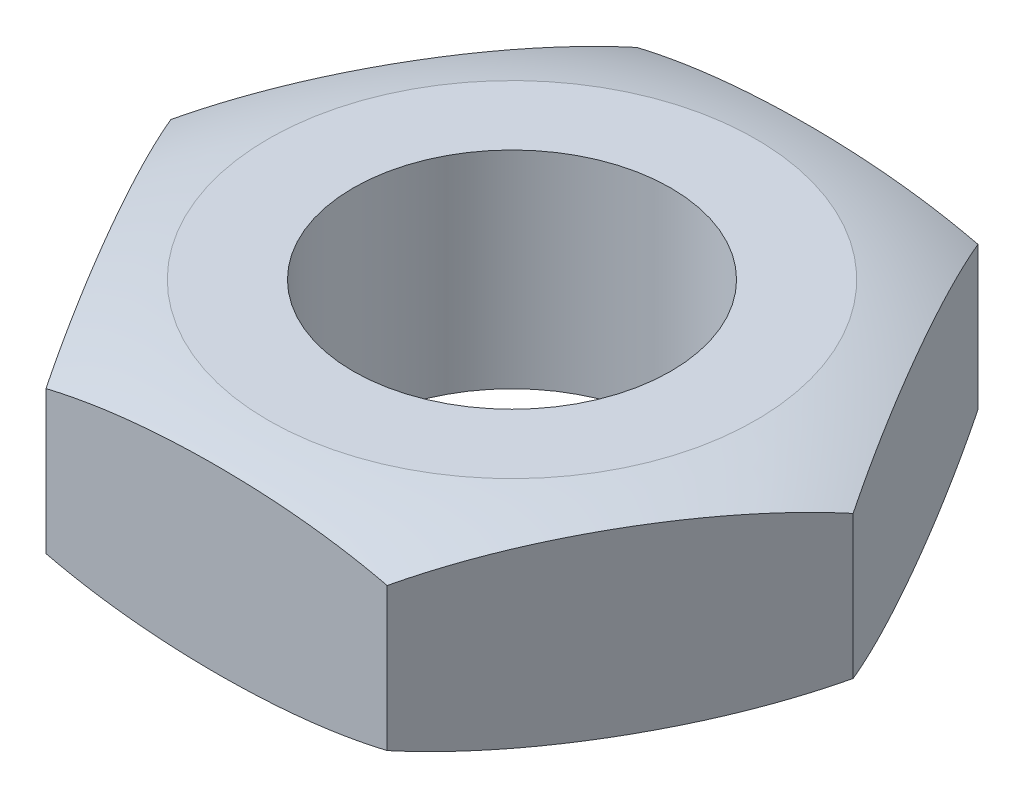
from build123d import *

# Parameters (mm, degrees)
EXTRUDE1_DEPTH           = 11.1125
F_1_1_2_6_TAPPED_HOLE1_D = 34.13252


with BuildPart() as part:
    # Sketch1 → Extrude1 (new, symmetric)
    with BuildSketch(Plane(origin=(0, 0, 0), x_dir=(1, 0, 0), z_dir=(0, 1, 0))):
        Polygon((36.661742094, 0), (18.330871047, 31.75), (-18.330871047, 31.75), (-36.661742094, 0), (-18.330871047, -31.75), (18.330871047, -31.75), align=None)
    extrude(amount=EXTRUDE1_DEPTH, both=True)

    # 1-1_2-6 Tapped Hole1 (through all)
    with Locations(Plane(origin=(0, 11.1125, 0), x_dir=(-1, 0, 0), z_dir=(0, 1, 0))):
        with Locations((0, 0)):
            Hole(F_1_1_2_6_TAPPED_HOLE1_D / 2)

    # Sketch4 → Cut-Revolve1 (revolve, cut)
    with BuildSketch(Plane.XY, mode=Mode.PRIVATE) as cut_revolve1_sk:
        with BuildLine():
            Line((-20.525280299, 11.79569642), (-20.525280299, 33.328983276))
            Line((-20.525280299, 33.328983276), (-36.661742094, 33.328983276))
            Line((-36.661742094, 33.328983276), (-36.661742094, 7.68339026))
            ThreePointArc((-36.661742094, 7.68339026), (-28.796493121, 10.536033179), (-20.525280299, 11.79569642))
        make_face()
    cut_revolve1 = revolve(cut_revolve1_sk.sketch.rotate(Axis((0, 0, 0), (0, 1, 0)), 90), axis=Axis((0, 0, 0), (0, 1, 0)), mode=Mode.SUBTRACT)

    # Mirror1: Cut-Revolve1 across plane
    add(cut_revolve1.mirror(Plane.ZX), mode=Mode.SUBTRACT)


solid = part.part
